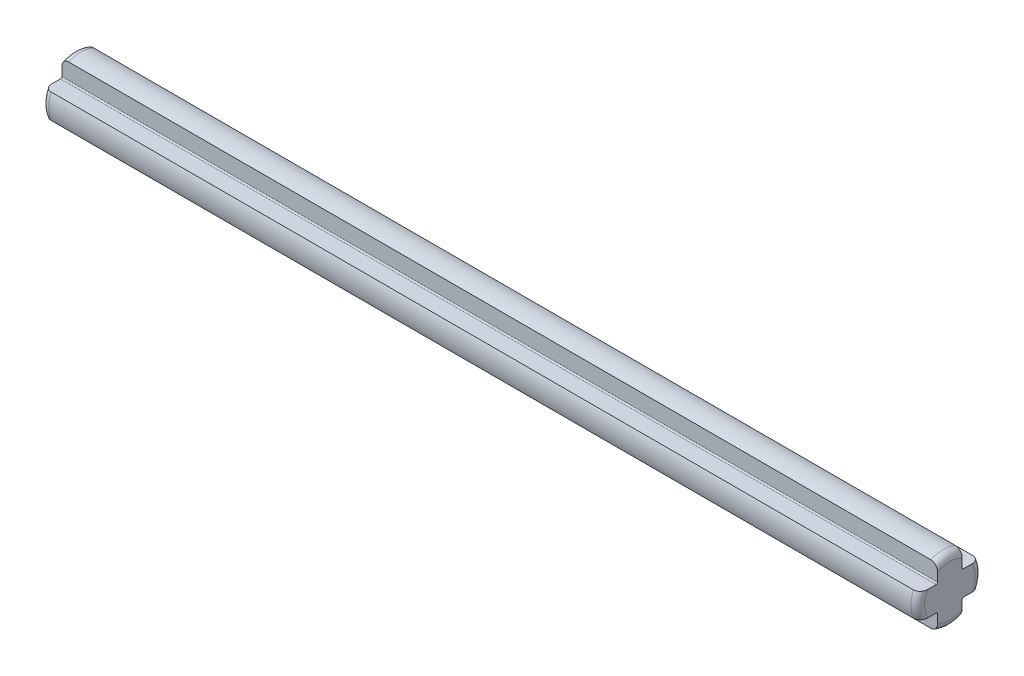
ISO-10303-21;
HEADER;
FILE_DESCRIPTION(('STEP AP214'),'2;1');
FILE_NAME('part.step','',(''),(''),'','','');
FILE_SCHEMA(('AUTOMOTIVE_DESIGN { 1 0 10303 214 1 1 1 1 }'));
ENDSEC;
DATA;
#1=APPLICATION_CONTEXT('core data for automotive mechanical design processes');
#2=APPLICATION_PROTOCOL_DEFINITION('international standard','automotive_design',2000,#1);
#3=PRODUCT_CONTEXT('',#1,'mechanical');
#4=PRODUCT('Part','Part','',(#3));
#5=PRODUCT_RELATED_PRODUCT_CATEGORY('part','',(#4));
#6=PRODUCT_DEFINITION_FORMATION('','',#4);
#7=PRODUCT_DEFINITION_CONTEXT('part definition',#1,'design');
#8=PRODUCT_DEFINITION('design','',#6,#7);
#9=PRODUCT_DEFINITION_SHAPE('','',#8);
#10=(LENGTH_UNIT() NAMED_UNIT(*) SI_UNIT(.MILLI.,.METRE.));
#11=(NAMED_UNIT(*) PLANE_ANGLE_UNIT() SI_UNIT($,.RADIAN.));
#12=(NAMED_UNIT(*) SI_UNIT($,.STERADIAN.) SOLID_ANGLE_UNIT());
#13=UNCERTAINTY_MEASURE_WITH_UNIT(LENGTH_MEASURE(1.E-05),#10,'distance_accuracy_value','');
#14=(GEOMETRIC_REPRESENTATION_CONTEXT(3) GLOBAL_UNCERTAINTY_ASSIGNED_CONTEXT((#13)) GLOBAL_UNIT_ASSIGNED_CONTEXT((#10,
#11,#12)) REPRESENTATION_CONTEXT('',''));
#15=CARTESIAN_POINT('',(0.,0.,0.));
#16=DIRECTION('',(0.,0.,1.));
#17=DIRECTION('',(1.,0.,0.));
#18=AXIS2_PLACEMENT_3D('',#15,#16,#17);
#19=CARTESIAN_POINT('',(32.,0.,0.));
#20=DIRECTION('',(-1.,0.,0.));
#21=DIRECTION('',(0.,0.,1.));
#22=AXIS2_PLACEMENT_3D('',#19,#20,#21);
#23=CYLINDRICAL_SURFACE('',#22,2.35);
#24=DIRECTION('',(-1.,0.,0.));
#25=VECTOR('',#24,1.);
#26=CARTESIAN_POINT('',(32.,0.9,2.17082933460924));
#27=LINE('',#26,#25);
#28=CARTESIAN_POINT('',(31.5,0.9,2.17082933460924));
#29=VERTEX_POINT('',#28);
#30=CARTESIAN_POINT('',(-31.5,0.9,2.17082933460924));
#31=VERTEX_POINT('',#30);
#32=EDGE_CURVE('E250',#29,#31,#27,.T.);
#33=ORIENTED_EDGE('',*,*,#32,.T.);
#34=CARTESIAN_POINT('',(-31.5,0.,0.));
#35=DIRECTION('',(1.,0.,0.));
#36=DIRECTION('',(0.,0.,-1.));
#37=AXIS2_PLACEMENT_3D('',#34,#35,#36);
#38=CIRCLE('',#37,2.35);
#39=CARTESIAN_POINT('',(-31.5,-0.900000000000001,2.17082933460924));
#40=VERTEX_POINT('',#39);
#41=EDGE_CURVE('E515',#31,#40,#38,.T.);
#42=ORIENTED_EDGE('',*,*,#41,.T.);
#43=DIRECTION('',(-1.,0.,0.));
#44=VECTOR('',#43,1.);
#45=CARTESIAN_POINT('',(32.,-0.900000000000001,2.17082933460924));
#46=LINE('',#45,#44);
#47=CARTESIAN_POINT('',(31.5,-0.900000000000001,2.17082933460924));
#48=VERTEX_POINT('',#47);
#49=EDGE_CURVE('E221',#48,#40,#46,.T.);
#50=ORIENTED_EDGE('',*,*,#49,.F.);
#51=CARTESIAN_POINT('',(31.5,0.,0.));
#52=DIRECTION('',(1.,0.,0.));
#53=DIRECTION('',(0.,0.,-1.));
#54=AXIS2_PLACEMENT_3D('',#51,#52,#53);
#55=CIRCLE('',#54,2.35);
#56=EDGE_CURVE('E370',#48,#29,#55,.F.);
#57=ORIENTED_EDGE('',*,*,#56,.T.);
#58=EDGE_LOOP('',(#33,#42,#50,#57));
#59=FACE_BOUND('',#58,.T.);
#60=ADVANCED_FACE('F37',(#59),#23,.T.);
#61=CARTESIAN_POINT('',(32.,-0.900000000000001,2.17082933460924));
#62=DIRECTION('',(0.,1.,0.));
#63=DIRECTION('',(0.,0.,1.));
#64=AXIS2_PLACEMENT_3D('',#61,#62,#63);
#65=PLANE('',#64);
#66=ORIENTED_EDGE('',*,*,#49,.T.);
#67=CARTESIAN_POINT('',(-31.5,-0.900000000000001,2.17082933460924));
#68=CARTESIAN_POINT('',(-31.5264833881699,-0.900000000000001,2.17085986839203));
#69=CARTESIAN_POINT('',(-31.5529498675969,-0.900000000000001,2.16855372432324));
#70=CARTESIAN_POINT('',(-31.6050453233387,-0.900000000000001,2.15950506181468));
#71=CARTESIAN_POINT('',(-31.6306762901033,-0.900000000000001,2.15277404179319));
#72=CARTESIAN_POINT('',(-31.6804387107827,-0.900000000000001,2.1351114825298));
#73=CARTESIAN_POINT('',(-31.7045703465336,-0.900000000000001,2.12418045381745));
#74=CARTESIAN_POINT('',(-31.7507251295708,-0.900000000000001,2.09852306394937));
#75=CARTESIAN_POINT('',(-31.7727475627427,-0.900000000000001,2.0837954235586));
#76=CARTESIAN_POINT('',(-31.8147234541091,-0.900000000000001,2.05060839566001));
#77=CARTESIAN_POINT('',(-31.8346070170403,-0.900000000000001,2.03206082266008));
#78=CARTESIAN_POINT('',(-31.8712243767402,-0.900000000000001,1.99209288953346));
#79=CARTESIAN_POINT('',(-31.8879579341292,-0.900000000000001,1.97067231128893));
#80=CARTESIAN_POINT('',(-31.9190973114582,-0.900000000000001,1.92396602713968));
#81=CARTESIAN_POINT('',(-31.9332527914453,-0.900000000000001,1.89851375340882));
#82=CARTESIAN_POINT('',(-31.9575247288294,-0.900000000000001,1.84573102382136));
#83=CARTESIAN_POINT('',(-31.9676367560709,-0.900000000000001,1.81839854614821));
#84=CARTESIAN_POINT('',(-31.9838866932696,-0.900000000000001,1.76219756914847));
#85=CARTESIAN_POINT('',(-31.9899702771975,-0.900000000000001,1.73331353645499));
#86=CARTESIAN_POINT('',(-31.9980270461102,-0.900000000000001,1.67505065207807));
#87=CARTESIAN_POINT('',(-32.0000109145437,-0.900000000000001,1.64567328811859));
#88=CARTESIAN_POINT('',(-32.,-0.900000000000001,1.61632298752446));
#89=B_SPLINE_CURVE_WITH_KNOTS('',3,(#67,#68,#69,#70,#71,#72,#73,#74,#75,#76,#77,#78,#79,#80,#81,
#82,#83,#84,#85,#86,#87,#88),.UNSPECIFIED.,.F.,.F.,(4,2,2,2,2,2,2,2,2,2,4),(0.,
0.0793238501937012,0.158442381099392,0.237551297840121,0.316686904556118,0.397909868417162,
0.479139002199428,0.56614777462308,0.653251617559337,0.74150740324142,0.829532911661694),.UNSPECIFIED.);
#90=CARTESIAN_POINT('',(-32.,-0.900000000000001,1.61632298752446));
#91=VERTEX_POINT('',#90);
#92=EDGE_CURVE('E390',#40,#91,#89,.T.);
#93=ORIENTED_EDGE('',*,*,#92,.T.);
#94=DIRECTION('',(0.,0.,-1.));
#95=VECTOR('',#94,1.);
#96=CARTESIAN_POINT('',(-32.,-0.900000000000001,2.17082933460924));
#97=LINE('',#96,#95);
#98=CARTESIAN_POINT('',(-32.,-0.900000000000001,0.999999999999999));
#99=VERTEX_POINT('',#98);
#100=EDGE_CURVE('E218',#91,#99,#97,.T.);
#101=ORIENTED_EDGE('',*,*,#100,.T.);
#102=DIRECTION('',(-1.,0.,0.));
#103=VECTOR('',#102,1.);
#104=CARTESIAN_POINT('',(32.,-0.900000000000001,0.999999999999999));
#105=LINE('',#104,#103);
#106=CARTESIAN_POINT('',(32.,-0.900000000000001,0.999999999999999));
#107=VERTEX_POINT('',#106);
#108=EDGE_CURVE('E214',#107,#99,#105,.T.);
#109=ORIENTED_EDGE('',*,*,#108,.F.);
#110=DIRECTION('',(0.,0.,-1.));
#111=VECTOR('',#110,1.);
#112=CARTESIAN_POINT('',(32.,-0.900000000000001,2.17082933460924));
#113=LINE('',#112,#111);
#114=CARTESIAN_POINT('',(32.,-0.900000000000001,1.61632298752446));
#115=VERTEX_POINT('',#114);
#116=EDGE_CURVE('E201',#115,#107,#113,.T.);
#117=ORIENTED_EDGE('',*,*,#116,.F.);
#118=CARTESIAN_POINT('',(32.,-0.900000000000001,1.61632298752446));
#119=CARTESIAN_POINT('',(32.0000222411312,-0.900000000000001,1.65066661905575));
#120=CARTESIAN_POINT('',(31.9972983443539,-0.900000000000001,1.68506058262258));
#121=CARTESIAN_POINT('',(31.9862156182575,-0.900000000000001,1.75308687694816));
#122=CARTESIAN_POINT('',(31.9778303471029,-0.900000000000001,1.78671486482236));
#123=CARTESIAN_POINT('',(31.9552419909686,-0.900000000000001,1.85211366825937));
#124=CARTESIAN_POINT('',(31.9410195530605,-0.900000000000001,1.88387790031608));
#125=CARTESIAN_POINT('',(31.9069131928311,-0.900000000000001,1.94414749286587));
#126=CARTESIAN_POINT('',(31.8870416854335,-0.900000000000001,1.97265980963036));
#127=CARTESIAN_POINT('',(31.844222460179,-0.900000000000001,2.02268935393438));
#128=CARTESIAN_POINT('',(31.8217526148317,-0.900000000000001,2.04461521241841));
#129=CARTESIAN_POINT('',(31.7730890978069,-0.900000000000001,2.08389547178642));
#130=CARTESIAN_POINT('',(31.7468952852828,-0.900000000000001,2.10124969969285));
#131=CARTESIAN_POINT('',(31.6943438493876,-0.900000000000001,2.12912089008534));
#132=CARTESIAN_POINT('',(31.6682509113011,-0.900000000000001,2.14013932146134));
#133=CARTESIAN_POINT('',(31.6145341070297,-0.900000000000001,2.15730052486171));
#134=CARTESIAN_POINT('',(31.586913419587,-0.900000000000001,2.1634530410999));
#135=CARTESIAN_POINT('',(31.5492135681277,-0.900000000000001,2.16830749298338));
#136=CARTESIAN_POINT('',(31.5393866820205,-0.900000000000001,2.1692533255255));
#137=CARTESIAN_POINT('',(31.5197081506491,-0.900000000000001,2.17051341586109));
#138=CARTESIAN_POINT('',(31.5098565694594,-0.900000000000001,2.17082867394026));
#139=CARTESIAN_POINT('',(31.5,-0.900000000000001,2.17082933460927));
#140=B_SPLINE_CURVE_WITH_KNOTS('',3,(#118,#119,#120,#121,#122,#123,#124,#125,#126,#127,#128,
#129,#130,#131,#132,#133,#134,#135,#136,#137,#138,#139),.UNSPECIFIED.,.F.,.F.,(4,2,2,2,2,2,2,2,
2,2,4),(0.,0.10300027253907,0.206484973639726,0.310315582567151,0.413919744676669,
0.507586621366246,0.601257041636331,0.68579977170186,0.770172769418,0.799774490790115,
0.829329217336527),.UNSPECIFIED.);
#141=EDGE_CURVE('E520',#115,#48,#140,.T.);
#142=ORIENTED_EDGE('',*,*,#141,.T.);
#143=EDGE_LOOP('',(#66,#93,#101,#109,#117,#142));
#144=FACE_BOUND('',#143,.T.);
#145=ADVANCED_FACE('F216',(#144),#65,.F.);
#146=CARTESIAN_POINT('',(32.,-1.,0.999999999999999));
#147=DIRECTION('',(-1.,0.,0.));
#148=DIRECTION('',(0.,0.,1.));
#149=AXIS2_PLACEMENT_3D('',#146,#147,#148);
#150=CYLINDRICAL_SURFACE('',#149,0.0999999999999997);
#151=CARTESIAN_POINT('',(-32.,-1.,0.999999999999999));
#152=DIRECTION('',(-1.,0.,0.));
#153=DIRECTION('',(0.,0.,1.));
#154=AXIS2_PLACEMENT_3D('',#151,#152,#153);
#155=CIRCLE('',#154,0.0999999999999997);
#156=CARTESIAN_POINT('',(-32.,-1.,0.899999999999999));
#157=VERTEX_POINT('',#156);
#158=EDGE_CURVE('E252',#99,#157,#155,.T.);
#159=ORIENTED_EDGE('',*,*,#158,.T.);
#160=DIRECTION('',(-1.,0.,0.));
#161=VECTOR('',#160,1.);
#162=CARTESIAN_POINT('',(32.,-1.,0.899999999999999));
#163=LINE('',#162,#161);
#164=CARTESIAN_POINT('',(32.,-1.,0.899999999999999));
#165=VERTEX_POINT('',#164);
#166=EDGE_CURVE('E222',#165,#157,#163,.T.);
#167=ORIENTED_EDGE('',*,*,#166,.F.);
#168=CARTESIAN_POINT('',(32.,-1.,0.999999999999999));
#169=DIRECTION('',(-1.,0.,0.));
#170=DIRECTION('',(0.,0.,1.));
#171=AXIS2_PLACEMENT_3D('',#168,#169,#170);
#172=CIRCLE('',#171,0.0999999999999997);
#173=EDGE_CURVE('E207',#107,#165,#172,.T.);
#174=ORIENTED_EDGE('',*,*,#173,.F.);
#175=ORIENTED_EDGE('',*,*,#108,.T.);
#176=EDGE_LOOP('',(#159,#167,#174,#175));
#177=FACE_BOUND('',#176,.T.);
#178=ADVANCED_FACE('F224',(#177),#150,.F.);
#179=CARTESIAN_POINT('',(32.,-2.17082933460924,0.899999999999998));
#180=DIRECTION('',(0.,0.,-1.));
#181=DIRECTION('',(0.,1.,0.));
#182=AXIS2_PLACEMENT_3D('',#179,#180,#181);
#183=PLANE('',#182);
#184=DIRECTION('',(0.,-1.,0.));
#185=VECTOR('',#184,1.);
#186=CARTESIAN_POINT('',(-32.,-2.17082933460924,0.899999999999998));
#187=LINE('',#186,#185);
#188=CARTESIAN_POINT('',(-32.,-1.61632298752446,0.899999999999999));
#189=VERTEX_POINT('',#188);
#190=EDGE_CURVE('E254',#157,#189,#187,.T.);
#191=ORIENTED_EDGE('',*,*,#190,.T.);
#192=CARTESIAN_POINT('',(-32.,-1.61632298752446,0.899999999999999));
#193=CARTESIAN_POINT('',(-32.0000222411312,-1.65066661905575,0.899999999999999));
#194=CARTESIAN_POINT('',(-31.9972983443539,-1.68506058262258,0.899999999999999));
#195=CARTESIAN_POINT('',(-31.9862156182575,-1.75308687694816,0.899999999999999));
#196=CARTESIAN_POINT('',(-31.9778303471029,-1.78671486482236,0.899999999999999));
#197=CARTESIAN_POINT('',(-31.9552419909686,-1.85211366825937,0.899999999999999));
#198=CARTESIAN_POINT('',(-31.9410195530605,-1.88387790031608,0.899999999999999));
#199=CARTESIAN_POINT('',(-31.9069131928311,-1.94414749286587,0.899999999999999));
#200=CARTESIAN_POINT('',(-31.8870416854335,-1.97265980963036,0.899999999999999));
#201=CARTESIAN_POINT('',(-31.844222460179,-2.02268935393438,0.899999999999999));
#202=CARTESIAN_POINT('',(-31.8217526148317,-2.04461521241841,0.899999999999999));
#203=CARTESIAN_POINT('',(-31.7730890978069,-2.08389547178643,0.899999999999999));
#204=CARTESIAN_POINT('',(-31.7468952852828,-2.10124969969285,0.899999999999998));
#205=CARTESIAN_POINT('',(-31.6943438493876,-2.12912089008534,0.899999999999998));
#206=CARTESIAN_POINT('',(-31.6682509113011,-2.14013932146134,0.899999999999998));
#207=CARTESIAN_POINT('',(-31.6145341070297,-2.15730052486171,0.899999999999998));
#208=CARTESIAN_POINT('',(-31.586913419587,-2.1634530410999,0.899999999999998));
#209=CARTESIAN_POINT('',(-31.5492135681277,-2.16830749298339,0.899999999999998));
#210=CARTESIAN_POINT('',(-31.5393866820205,-2.1692533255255,0.899999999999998));
#211=CARTESIAN_POINT('',(-31.5197081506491,-2.17051341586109,0.899999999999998));
#212=CARTESIAN_POINT('',(-31.5098565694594,-2.17082867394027,0.899999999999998));
#213=CARTESIAN_POINT('',(-31.5,-2.17082933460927,0.899999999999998));
#214=B_SPLINE_CURVE_WITH_KNOTS('',3,(#192,#193,#194,#195,#196,#197,#198,#199,#200,#201,#202,
#203,#204,#205,#206,#207,#208,#209,#210,#211,#212,#213),.UNSPECIFIED.,.F.,.F.,(4,2,2,2,2,2,2,2,
2,2,4),(0.,0.103000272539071,0.206484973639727,0.310315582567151,0.413919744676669,
0.507586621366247,0.601257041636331,0.68579977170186,0.770172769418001,0.799774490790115,
0.829329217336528),.UNSPECIFIED.);
#215=CARTESIAN_POINT('',(-31.5,-2.17082933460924,0.899999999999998));
#216=VERTEX_POINT('',#215);
#217=EDGE_CURVE('E365',#189,#216,#214,.T.);
#218=ORIENTED_EDGE('',*,*,#217,.T.);
#219=DIRECTION('',(-1.,0.,0.));
#220=VECTOR('',#219,1.);
#221=CARTESIAN_POINT('',(32.,-2.17082933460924,0.899999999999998));
#222=LINE('',#221,#220);
#223=CARTESIAN_POINT('',(31.5,-2.17082933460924,0.899999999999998));
#224=VERTEX_POINT('',#223);
#225=EDGE_CURVE('E312',#224,#216,#222,.T.);
#226=ORIENTED_EDGE('',*,*,#225,.F.);
#227=CARTESIAN_POINT('',(31.5,-2.17082933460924,0.899999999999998));
#228=CARTESIAN_POINT('',(31.5264833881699,-2.17085986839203,0.899999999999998));
#229=CARTESIAN_POINT('',(31.5529498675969,-2.16855372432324,0.899999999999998));
#230=CARTESIAN_POINT('',(31.6050453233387,-2.15950506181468,0.899999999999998));
#231=CARTESIAN_POINT('',(31.6306762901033,-2.15277404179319,0.899999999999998));
#232=CARTESIAN_POINT('',(31.6804387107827,-2.1351114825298,0.899999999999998));
#233=CARTESIAN_POINT('',(31.7045703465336,-2.12418045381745,0.899999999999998));
#234=CARTESIAN_POINT('',(31.7507251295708,-2.09852306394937,0.899999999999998));
#235=CARTESIAN_POINT('',(31.7727475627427,-2.0837954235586,0.899999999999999));
#236=CARTESIAN_POINT('',(31.8147234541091,-2.05060839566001,0.899999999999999));
#237=CARTESIAN_POINT('',(31.8346070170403,-2.03206082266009,0.899999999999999));
#238=CARTESIAN_POINT('',(31.8712243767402,-1.99209288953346,0.899999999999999));
#239=CARTESIAN_POINT('',(31.8879579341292,-1.97067231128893,0.899999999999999));
#240=CARTESIAN_POINT('',(31.9190973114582,-1.92396602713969,0.899999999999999));
#241=CARTESIAN_POINT('',(31.9332527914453,-1.89851375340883,0.899999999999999));
#242=CARTESIAN_POINT('',(31.9575247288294,-1.84573102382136,0.899999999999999));
#243=CARTESIAN_POINT('',(31.9676367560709,-1.81839854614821,0.899999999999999));
#244=CARTESIAN_POINT('',(31.9838866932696,-1.76219756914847,0.899999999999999));
#245=CARTESIAN_POINT('',(31.9899702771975,-1.733313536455,0.899999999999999));
#246=CARTESIAN_POINT('',(31.9980270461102,-1.67505065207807,0.899999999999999));
#247=CARTESIAN_POINT('',(32.0000109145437,-1.64567328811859,0.899999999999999));
#248=CARTESIAN_POINT('',(32.,-1.61632298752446,0.899999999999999));
#249=B_SPLINE_CURVE_WITH_KNOTS('',3,(#227,#228,#229,#230,#231,#232,#233,#234,#235,#236,#237,
#238,#239,#240,#241,#242,#243,#244,#245,#246,#247,#248),.UNSPECIFIED.,.F.,.F.,(4,2,2,2,2,2,2,2,
2,2,4),(0.,0.0793238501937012,0.158442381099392,0.237551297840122,0.316686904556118,
0.397909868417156,0.479139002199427,0.566147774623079,0.653251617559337,0.741507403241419,
0.829532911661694),.UNSPECIFIED.);
#250=CARTESIAN_POINT('',(32.,-1.61632298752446,0.899999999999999));
#251=VERTEX_POINT('',#250);
#252=EDGE_CURVE('E359',#224,#251,#249,.T.);
#253=ORIENTED_EDGE('',*,*,#252,.T.);
#254=DIRECTION('',(0.,-1.,0.));
#255=VECTOR('',#254,1.);
#256=CARTESIAN_POINT('',(32.,-2.17082933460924,0.899999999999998));
#257=LINE('',#256,#255);
#258=EDGE_CURVE('E227',#165,#251,#257,.T.);
#259=ORIENTED_EDGE('',*,*,#258,.F.);
#260=ORIENTED_EDGE('',*,*,#166,.T.);
#261=EDGE_LOOP('',(#191,#218,#226,#253,#259,#260));
#262=FACE_BOUND('',#261,.T.);
#263=ADVANCED_FACE('F350',(#262),#183,.F.);
#264=CARTESIAN_POINT('',(32.,0.,0.));
#265=DIRECTION('',(-1.,0.,0.));
#266=DIRECTION('',(0.,0.,1.));
#267=AXIS2_PLACEMENT_3D('',#264,#265,#266);
#268=CYLINDRICAL_SURFACE('',#267,2.35);
#269=ORIENTED_EDGE('',*,*,#225,.T.);
#270=CARTESIAN_POINT('',(-31.5,0.,0.));
#271=DIRECTION('',(1.,0.,0.));
#272=DIRECTION('',(0.,0.,-1.));
#273=AXIS2_PLACEMENT_3D('',#270,#271,#272);
#274=CIRCLE('',#273,2.35);
#275=CARTESIAN_POINT('',(-31.5,-2.17082933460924,-0.9));
#276=VERTEX_POINT('',#275);
#277=EDGE_CURVE('E319',#216,#276,#274,.T.);
#278=ORIENTED_EDGE('',*,*,#277,.T.);
#279=DIRECTION('',(-1.,0.,0.));
#280=VECTOR('',#279,1.);
#281=CARTESIAN_POINT('',(32.,-2.17082933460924,-0.9));
#282=LINE('',#281,#280);
#283=CARTESIAN_POINT('',(31.5,-2.17082933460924,-0.9));
#284=VERTEX_POINT('',#283);
#285=EDGE_CURVE('E309',#284,#276,#282,.T.);
#286=ORIENTED_EDGE('',*,*,#285,.F.);
#287=CARTESIAN_POINT('',(31.5,0.,0.));
#288=DIRECTION('',(1.,0.,0.));
#289=DIRECTION('',(0.,0.,-1.));
#290=AXIS2_PLACEMENT_3D('',#287,#288,#289);
#291=CIRCLE('',#290,2.35);
#292=EDGE_CURVE('E317',#284,#224,#291,.F.);
#293=ORIENTED_EDGE('',*,*,#292,.T.);
#294=EDGE_LOOP('',(#269,#278,#286,#293));
#295=FACE_BOUND('',#294,.T.);
#296=ADVANCED_FACE('F344',(#295),#268,.T.);
#297=CARTESIAN_POINT('',(32.,-2.17082933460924,-0.9));
#298=DIRECTION('',(0.,0.,1.));
#299=DIRECTION('',(0.,-1.,0.));
#300=AXIS2_PLACEMENT_3D('',#297,#298,#299);
#301=PLANE('',#300);
#302=ORIENTED_EDGE('',*,*,#285,.T.);
#303=CARTESIAN_POINT('',(-31.5,-2.17082933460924,-0.9));
#304=CARTESIAN_POINT('',(-31.5264833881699,-2.17085986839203,-0.9));
#305=CARTESIAN_POINT('',(-31.5529498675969,-2.16855372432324,-0.9));
#306=CARTESIAN_POINT('',(-31.6050453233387,-2.15950506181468,-0.9));
#307=CARTESIAN_POINT('',(-31.6306762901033,-2.15277404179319,-0.9));
#308=CARTESIAN_POINT('',(-31.6804387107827,-2.1351114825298,-0.9));
#309=CARTESIAN_POINT('',(-31.7045703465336,-2.12418045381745,-0.9));
#310=CARTESIAN_POINT('',(-31.7507251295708,-2.09852306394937,-0.9));
#311=CARTESIAN_POINT('',(-31.7727475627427,-2.0837954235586,-0.9));
#312=CARTESIAN_POINT('',(-31.8147234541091,-2.05060839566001,-0.9));
#313=CARTESIAN_POINT('',(-31.8346070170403,-2.03206082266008,-0.9));
#314=CARTESIAN_POINT('',(-31.8712243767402,-1.99209288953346,-0.9));
#315=CARTESIAN_POINT('',(-31.8879579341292,-1.97067231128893,-0.9));
#316=CARTESIAN_POINT('',(-31.9190973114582,-1.92396602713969,-0.9));
#317=CARTESIAN_POINT('',(-31.9332527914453,-1.89851375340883,-0.9));
#318=CARTESIAN_POINT('',(-31.9575247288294,-1.84573102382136,-0.9));
#319=CARTESIAN_POINT('',(-31.9676367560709,-1.81839854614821,-0.9));
#320=CARTESIAN_POINT('',(-31.9838866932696,-1.76219756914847,-0.9));
#321=CARTESIAN_POINT('',(-31.9899702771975,-1.73331353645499,-0.9));
#322=CARTESIAN_POINT('',(-31.9980270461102,-1.67505065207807,-0.9));
#323=CARTESIAN_POINT('',(-32.0000109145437,-1.64567328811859,-0.9));
#324=CARTESIAN_POINT('',(-32.,-1.61632298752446,-0.9));
#325=B_SPLINE_CURVE_WITH_KNOTS('',3,(#303,#304,#305,#306,#307,#308,#309,#310,#311,#312,#313,
#314,#315,#316,#317,#318,#319,#320,#321,#322,#323,#324),.UNSPECIFIED.,.F.,.F.,(4,2,2,2,2,2,2,2,
2,2,4),(0.,0.0793238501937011,0.158442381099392,0.237551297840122,0.316686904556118,
0.397909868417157,0.479139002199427,0.566147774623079,0.653251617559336,0.74150740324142,
0.829532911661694),.UNSPECIFIED.);
#326=CARTESIAN_POINT('',(-32.,-1.61632298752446,-0.9));
#327=VERTEX_POINT('',#326);
#328=EDGE_CURVE('E329',#276,#327,#325,.T.);
#329=ORIENTED_EDGE('',*,*,#328,.T.);
#330=DIRECTION('',(0.,1.,0.));
#331=VECTOR('',#330,1.);
#332=CARTESIAN_POINT('',(-32.,-2.17082933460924,-0.9));
#333=LINE('',#332,#331);
#334=CARTESIAN_POINT('',(-32.,-1.,-0.9));
#335=VERTEX_POINT('',#334);
#336=EDGE_CURVE('E257',#327,#335,#333,.T.);
#337=ORIENTED_EDGE('',*,*,#336,.T.);
#338=DIRECTION('',(-1.,0.,0.));
#339=VECTOR('',#338,1.);
#340=CARTESIAN_POINT('',(32.,-1.,-0.9));
#341=LINE('',#340,#339);
#342=CARTESIAN_POINT('',(32.,-1.,-0.9));
#343=VERTEX_POINT('',#342);
#344=EDGE_CURVE('E306',#343,#335,#341,.T.);
#345=ORIENTED_EDGE('',*,*,#344,.F.);
#346=DIRECTION('',(0.,1.,0.));
#347=VECTOR('',#346,1.);
#348=CARTESIAN_POINT('',(32.,-2.17082933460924,-0.9));
#349=LINE('',#348,#347);
#350=CARTESIAN_POINT('',(32.,-1.61632298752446,-0.9));
#351=VERTEX_POINT('',#350);
#352=EDGE_CURVE('E229',#351,#343,#349,.T.);
#353=ORIENTED_EDGE('',*,*,#352,.F.);
#354=CARTESIAN_POINT('',(32.,-1.61632298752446,-0.9));
#355=CARTESIAN_POINT('',(32.0000222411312,-1.65066661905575,-0.9));
#356=CARTESIAN_POINT('',(31.9972983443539,-1.68506058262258,-0.9));
#357=CARTESIAN_POINT('',(31.9862156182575,-1.75308687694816,-0.9));
#358=CARTESIAN_POINT('',(31.9778303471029,-1.78671486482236,-0.9));
#359=CARTESIAN_POINT('',(31.9552419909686,-1.85211366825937,-0.9));
#360=CARTESIAN_POINT('',(31.9410195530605,-1.88387790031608,-0.9));
#361=CARTESIAN_POINT('',(31.9069131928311,-1.94414749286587,-0.9));
#362=CARTESIAN_POINT('',(31.8870416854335,-1.97265980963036,-0.9));
#363=CARTESIAN_POINT('',(31.844222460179,-2.02268935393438,-0.9));
#364=CARTESIAN_POINT('',(31.8217526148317,-2.04461521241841,-0.9));
#365=CARTESIAN_POINT('',(31.7730890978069,-2.08389547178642,-0.9));
#366=CARTESIAN_POINT('',(31.7468952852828,-2.10124969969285,-0.9));
#367=CARTESIAN_POINT('',(31.6943438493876,-2.12912089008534,-0.9));
#368=CARTESIAN_POINT('',(31.6682509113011,-2.14013932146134,-0.9));
#369=CARTESIAN_POINT('',(31.6145341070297,-2.15730052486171,-0.9));
#370=CARTESIAN_POINT('',(31.586913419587,-2.1634530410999,-0.9));
#371=CARTESIAN_POINT('',(31.5492135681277,-2.16830749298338,-0.9));
#372=CARTESIAN_POINT('',(31.5393866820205,-2.1692533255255,-0.9));
#373=CARTESIAN_POINT('',(31.5197081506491,-2.17051341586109,-0.9));
#374=CARTESIAN_POINT('',(31.5098565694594,-2.17082867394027,-0.9));
#375=CARTESIAN_POINT('',(31.5,-2.17082933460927,-0.9));
#376=B_SPLINE_CURVE_WITH_KNOTS('',3,(#354,#355,#356,#357,#358,#359,#360,#361,#362,#363,#364,
#365,#366,#367,#368,#369,#370,#371,#372,#373,#374,#375),.UNSPECIFIED.,.F.,.F.,(4,2,2,2,2,2,2,2,
2,2,4),(0.,0.10300027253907,0.206484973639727,0.310315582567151,0.413919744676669,
0.507586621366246,0.601257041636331,0.68579977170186,0.770172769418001,0.799774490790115,
0.829329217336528),.UNSPECIFIED.);
#377=EDGE_CURVE('E322',#351,#284,#376,.T.);
#378=ORIENTED_EDGE('',*,*,#377,.T.);
#379=EDGE_LOOP('',(#302,#329,#337,#345,#353,#378));
#380=FACE_BOUND('',#379,.T.);
#381=ADVANCED_FACE('F338',(#380),#301,.F.);
#382=CARTESIAN_POINT('',(32.,-1.,-1.));
#383=DIRECTION('',(-1.,0.,0.));
#384=DIRECTION('',(0.,0.,1.));
#385=AXIS2_PLACEMENT_3D('',#382,#383,#384);
#386=CYLINDRICAL_SURFACE('',#385,0.0999999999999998);
#387=CARTESIAN_POINT('',(-32.,-1.,-1.));
#388=DIRECTION('',(-1.,0.,0.));
#389=DIRECTION('',(0.,0.,-1.));
#390=AXIS2_PLACEMENT_3D('',#387,#388,#389);
#391=CIRCLE('',#390,0.0999999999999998);
#392=CARTESIAN_POINT('',(-32.,-0.9,-1.));
#393=VERTEX_POINT('',#392);
#394=EDGE_CURVE('E259',#335,#393,#391,.T.);
#395=ORIENTED_EDGE('',*,*,#394,.T.);
#396=DIRECTION('',(-1.,0.,0.));
#397=VECTOR('',#396,1.);
#398=CARTESIAN_POINT('',(32.,-0.9,-1.));
#399=LINE('',#398,#397);
#400=CARTESIAN_POINT('',(32.,-0.9,-1.));
#401=VERTEX_POINT('',#400);
#402=EDGE_CURVE('E303',#401,#393,#399,.T.);
#403=ORIENTED_EDGE('',*,*,#402,.F.);
#404=CARTESIAN_POINT('',(32.,-1.,-1.));
#405=DIRECTION('',(-1.,0.,0.));
#406=DIRECTION('',(0.,0.,-1.));
#407=AXIS2_PLACEMENT_3D('',#404,#405,#406);
#408=CIRCLE('',#407,0.0999999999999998);
#409=EDGE_CURVE('E233',#343,#401,#408,.T.);
#410=ORIENTED_EDGE('',*,*,#409,.F.);
#411=ORIENTED_EDGE('',*,*,#344,.T.);
#412=EDGE_LOOP('',(#395,#403,#410,#411));
#413=FACE_BOUND('',#412,.T.);
#414=ADVANCED_FACE('F343',(#413),#386,.F.);
#415=CARTESIAN_POINT('',(32.,-0.900000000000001,-2.17082933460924));
#416=DIRECTION('',(0.,1.,0.));
#417=DIRECTION('',(0.,0.,1.));
#418=AXIS2_PLACEMENT_3D('',#415,#416,#417);
#419=PLANE('',#418);
#420=DIRECTION('',(0.,0.,-1.));
#421=VECTOR('',#420,1.);
#422=CARTESIAN_POINT('',(-32.,-0.900000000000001,-2.17082933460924));
#423=LINE('',#422,#421);
#424=CARTESIAN_POINT('',(-32.,-0.9,-1.61632298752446));
#425=VERTEX_POINT('',#424);
#426=EDGE_CURVE('E261',#393,#425,#423,.T.);
#427=ORIENTED_EDGE('',*,*,#426,.T.);
#428=CARTESIAN_POINT('',(-32.,-0.9,-1.61632298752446));
#429=CARTESIAN_POINT('',(-32.0000222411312,-0.9,-1.65066661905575));
#430=CARTESIAN_POINT('',(-31.9972983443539,-0.9,-1.68506058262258));
#431=CARTESIAN_POINT('',(-31.9862156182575,-0.9,-1.75308687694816));
#432=CARTESIAN_POINT('',(-31.9778303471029,-0.9,-1.78671486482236));
#433=CARTESIAN_POINT('',(-31.9552419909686,-0.9,-1.85211366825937));
#434=CARTESIAN_POINT('',(-31.9410195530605,-0.9,-1.88387790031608));
#435=CARTESIAN_POINT('',(-31.9069131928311,-0.9,-1.94414749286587));
#436=CARTESIAN_POINT('',(-31.8870416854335,-0.9,-1.97265980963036));
#437=CARTESIAN_POINT('',(-31.844222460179,-0.9,-2.02268935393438));
#438=CARTESIAN_POINT('',(-31.8217526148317,-0.900000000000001,-2.04461521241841));
#439=CARTESIAN_POINT('',(-31.7730890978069,-0.900000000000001,-2.08389547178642));
#440=CARTESIAN_POINT('',(-31.7468952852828,-0.900000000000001,-2.10124969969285));
#441=CARTESIAN_POINT('',(-31.6943438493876,-0.900000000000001,-2.12912089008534));
#442=CARTESIAN_POINT('',(-31.6682509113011,-0.900000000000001,-2.14013932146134));
#443=CARTESIAN_POINT('',(-31.6145341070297,-0.900000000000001,-2.15730052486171));
#444=CARTESIAN_POINT('',(-31.586913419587,-0.900000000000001,-2.1634530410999));
#445=CARTESIAN_POINT('',(-31.5492135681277,-0.900000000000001,-2.16830749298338));
#446=CARTESIAN_POINT('',(-31.5393866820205,-0.900000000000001,-2.1692533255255));
#447=CARTESIAN_POINT('',(-31.5197081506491,-0.900000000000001,-2.17051341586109));
#448=CARTESIAN_POINT('',(-31.5098565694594,-0.900000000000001,-2.17082867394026));
#449=CARTESIAN_POINT('',(-31.5,-0.900000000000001,-2.17082933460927));
#450=B_SPLINE_CURVE_WITH_KNOTS('',3,(#428,#429,#430,#431,#432,#433,#434,#435,#436,#437,#438,
#439,#440,#441,#442,#443,#444,#445,#446,#447,#448,#449),.UNSPECIFIED.,.F.,.F.,(4,2,2,2,2,2,2,2,
2,2,4),(0.,0.103000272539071,0.206484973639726,0.310315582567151,0.413919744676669,
0.507586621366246,0.601257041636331,0.68579977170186,0.770172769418,0.799774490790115,
0.829329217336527),.UNSPECIFIED.);
#451=CARTESIAN_POINT('',(-31.5,-0.9,-2.17082933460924));
#452=VERTEX_POINT('',#451);
#453=EDGE_CURVE('E489',#425,#452,#450,.T.);
#454=ORIENTED_EDGE('',*,*,#453,.T.);
#455=DIRECTION('',(-1.,0.,0.));
#456=VECTOR('',#455,1.);
#457=CARTESIAN_POINT('',(32.,-0.9,-2.17082933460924));
#458=LINE('',#457,#456);
#459=CARTESIAN_POINT('',(31.5,-0.9,-2.17082933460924));
#460=VERTEX_POINT('',#459);
#461=EDGE_CURVE('E300',#460,#452,#458,.T.);
#462=ORIENTED_EDGE('',*,*,#461,.F.);
#463=CARTESIAN_POINT('',(31.5,-0.9,-2.17082933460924));
#464=CARTESIAN_POINT('',(31.5264833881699,-0.9,-2.17085986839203));
#465=CARTESIAN_POINT('',(31.5529498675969,-0.900000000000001,-2.16855372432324));
#466=CARTESIAN_POINT('',(31.6050453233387,-0.900000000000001,-2.15950506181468));
#467=CARTESIAN_POINT('',(31.6306762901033,-0.900000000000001,-2.15277404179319));
#468=CARTESIAN_POINT('',(31.6804387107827,-0.900000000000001,-2.1351114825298));
#469=CARTESIAN_POINT('',(31.7045703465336,-0.900000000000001,-2.12418045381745));
#470=CARTESIAN_POINT('',(31.7507251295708,-0.900000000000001,-2.09852306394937));
#471=CARTESIAN_POINT('',(31.7727475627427,-0.900000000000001,-2.0837954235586));
#472=CARTESIAN_POINT('',(31.8147234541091,-0.900000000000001,-2.05060839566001));
#473=CARTESIAN_POINT('',(31.8346070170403,-0.9,-2.03206082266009));
#474=CARTESIAN_POINT('',(31.8712243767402,-0.9,-1.99209288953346));
#475=CARTESIAN_POINT('',(31.8879579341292,-0.9,-1.97067231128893));
#476=CARTESIAN_POINT('',(31.9190973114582,-0.9,-1.92396602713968));
#477=CARTESIAN_POINT('',(31.9332527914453,-0.9,-1.89851375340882));
#478=CARTESIAN_POINT('',(31.9575247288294,-0.9,-1.84573102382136));
#479=CARTESIAN_POINT('',(31.9676367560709,-0.9,-1.81839854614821));
#480=CARTESIAN_POINT('',(31.9838866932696,-0.9,-1.76219756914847));
#481=CARTESIAN_POINT('',(31.9899702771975,-0.9,-1.73331353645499));
#482=CARTESIAN_POINT('',(31.9980270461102,-0.9,-1.67505065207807));
#483=CARTESIAN_POINT('',(32.0000109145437,-0.9,-1.64567328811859));
#484=CARTESIAN_POINT('',(32.,-0.9,-1.61632298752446));
#485=B_SPLINE_CURVE_WITH_KNOTS('',3,(#463,#464,#465,#466,#467,#468,#469,#470,#471,#472,#473,
#474,#475,#476,#477,#478,#479,#480,#481,#482,#483,#484),.UNSPECIFIED.,.F.,.F.,(4,2,2,2,2,2,2,2,
2,2,4),(0.,0.0793238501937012,0.158442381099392,0.237551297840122,0.316686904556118,
0.397909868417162,0.479139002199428,0.56614777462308,0.653251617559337,0.74150740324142,
0.829532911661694),.UNSPECIFIED.);
#486=CARTESIAN_POINT('',(32.,-0.9,-1.61632298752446));
#487=VERTEX_POINT('',#486);
#488=EDGE_CURVE('E53',#460,#487,#485,.T.);
#489=ORIENTED_EDGE('',*,*,#488,.T.);
#490=DIRECTION('',(0.,0.,-1.));
#491=VECTOR('',#490,1.);
#492=CARTESIAN_POINT('',(32.,-0.900000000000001,-2.17082933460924));
#493=LINE('',#492,#491);
#494=EDGE_CURVE('E235',#401,#487,#493,.T.);
#495=ORIENTED_EDGE('',*,*,#494,.F.);
#496=ORIENTED_EDGE('',*,*,#402,.T.);
#497=EDGE_LOOP('',(#427,#454,#462,#489,#495,#496));
#498=FACE_BOUND('',#497,.T.);
#499=ADVANCED_FACE('F496',(#498),#419,.F.);
#500=CARTESIAN_POINT('',(32.,0.,0.));
#501=DIRECTION('',(-1.,0.,0.));
#502=DIRECTION('',(0.,0.,1.));
#503=AXIS2_PLACEMENT_3D('',#500,#501,#502);
#504=CYLINDRICAL_SURFACE('',#503,2.35);
#505=ORIENTED_EDGE('',*,*,#461,.T.);
#506=CARTESIAN_POINT('',(-31.5,0.,0.));
#507=DIRECTION('',(1.,0.,0.));
#508=DIRECTION('',(0.,0.,-1.));
#509=AXIS2_PLACEMENT_3D('',#506,#507,#508);
#510=CIRCLE('',#509,2.35);
#511=CARTESIAN_POINT('',(-31.5,0.900000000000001,-2.17082933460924));
#512=VERTEX_POINT('',#511);
#513=EDGE_CURVE('E575',#452,#512,#510,.T.);
#514=ORIENTED_EDGE('',*,*,#513,.T.);
#515=DIRECTION('',(-1.,0.,0.));
#516=VECTOR('',#515,1.);
#517=CARTESIAN_POINT('',(32.,0.900000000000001,-2.17082933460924));
#518=LINE('',#517,#516);
#519=CARTESIAN_POINT('',(31.5,0.900000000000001,-2.17082933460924));
#520=VERTEX_POINT('',#519);
#521=EDGE_CURVE('E297',#520,#512,#518,.T.);
#522=ORIENTED_EDGE('',*,*,#521,.F.);
#523=CARTESIAN_POINT('',(31.5,0.,0.));
#524=DIRECTION('',(1.,0.,0.));
#525=DIRECTION('',(0.,0.,-1.));
#526=AXIS2_PLACEMENT_3D('',#523,#524,#525);
#527=CIRCLE('',#526,2.35);
#528=EDGE_CURVE('E574',#520,#460,#527,.F.);
#529=ORIENTED_EDGE('',*,*,#528,.T.);
#530=EDGE_LOOP('',(#505,#514,#522,#529));
#531=FACE_BOUND('',#530,.T.);
#532=ADVANCED_FACE('F464',(#531),#504,.T.);
#533=CARTESIAN_POINT('',(32.,0.900000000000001,-2.17082933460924));
#534=DIRECTION('',(0.,-1.,0.));
#535=DIRECTION('',(0.,0.,-1.));
#536=AXIS2_PLACEMENT_3D('',#533,#534,#535);
#537=PLANE('',#536);
#538=ORIENTED_EDGE('',*,*,#521,.T.);
#539=CARTESIAN_POINT('',(-31.5,0.900000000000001,-2.17082933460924));
#540=CARTESIAN_POINT('',(-31.5264833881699,0.900000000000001,-2.17085986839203));
#541=CARTESIAN_POINT('',(-31.5529498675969,0.900000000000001,-2.16855372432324));
#542=CARTESIAN_POINT('',(-31.6050453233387,0.900000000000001,-2.15950506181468));
#543=CARTESIAN_POINT('',(-31.6306762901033,0.900000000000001,-2.15277404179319));
#544=CARTESIAN_POINT('',(-31.6804387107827,0.900000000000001,-2.1351114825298));
#545=CARTESIAN_POINT('',(-31.7045703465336,0.900000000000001,-2.12418045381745));
#546=CARTESIAN_POINT('',(-31.7507251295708,0.900000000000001,-2.09852306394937));
#547=CARTESIAN_POINT('',(-31.7727475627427,0.900000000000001,-2.0837954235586));
#548=CARTESIAN_POINT('',(-31.8147234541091,0.900000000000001,-2.05060839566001));
#549=CARTESIAN_POINT('',(-31.8346070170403,0.9,-2.03206082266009));
#550=CARTESIAN_POINT('',(-31.8712243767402,0.9,-1.99209288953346));
#551=CARTESIAN_POINT('',(-31.8879579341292,0.9,-1.97067231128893));
#552=CARTESIAN_POINT('',(-31.9190973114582,0.9,-1.92396602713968));
#553=CARTESIAN_POINT('',(-31.9332527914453,0.9,-1.89851375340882));
#554=CARTESIAN_POINT('',(-31.9575247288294,0.9,-1.84573102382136));
#555=CARTESIAN_POINT('',(-31.9676367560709,0.9,-1.81839854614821));
#556=CARTESIAN_POINT('',(-31.9838866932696,0.9,-1.76219756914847));
#557=CARTESIAN_POINT('',(-31.9899702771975,0.9,-1.73331353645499));
#558=CARTESIAN_POINT('',(-31.9980270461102,0.9,-1.67505065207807));
#559=CARTESIAN_POINT('',(-32.0000109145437,0.9,-1.64567328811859));
#560=CARTESIAN_POINT('',(-32.,0.9,-1.61632298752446));
#561=B_SPLINE_CURVE_WITH_KNOTS('',3,(#539,#540,#541,#542,#543,#544,#545,#546,#547,#548,#549,
#550,#551,#552,#553,#554,#555,#556,#557,#558,#559,#560),.UNSPECIFIED.,.F.,.F.,(4,2,2,2,2,2,2,2,
2,2,4),(0.,0.0793238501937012,0.158442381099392,0.237551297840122,0.316686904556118,
0.397909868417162,0.479139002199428,0.56614777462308,0.653251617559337,0.74150740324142,
0.829532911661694),.UNSPECIFIED.);
#562=CARTESIAN_POINT('',(-32.,0.9,-1.61632298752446));
#563=VERTEX_POINT('',#562);
#564=EDGE_CURVE('E473',#512,#563,#561,.T.);
#565=ORIENTED_EDGE('',*,*,#564,.T.);
#566=DIRECTION('',(0.,0.,1.));
#567=VECTOR('',#566,1.);
#568=CARTESIAN_POINT('',(-32.,0.900000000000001,-2.17082933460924));
#569=LINE('',#568,#567);
#570=CARTESIAN_POINT('',(-32.,0.9,-1.));
#571=VERTEX_POINT('',#570);
#572=EDGE_CURVE('E264',#563,#571,#569,.T.);
#573=ORIENTED_EDGE('',*,*,#572,.T.);
#574=DIRECTION('',(-1.,0.,0.));
#575=VECTOR('',#574,1.);
#576=CARTESIAN_POINT('',(32.,0.9,-1.));
#577=LINE('',#576,#575);
#578=CARTESIAN_POINT('',(32.,0.9,-1.));
#579=VERTEX_POINT('',#578);
#580=EDGE_CURVE('E294',#579,#571,#577,.T.);
#581=ORIENTED_EDGE('',*,*,#580,.F.);
#582=DIRECTION('',(0.,0.,1.));
#583=VECTOR('',#582,1.);
#584=CARTESIAN_POINT('',(32.,0.900000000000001,-2.17082933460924));
#585=LINE('',#584,#583);
#586=CARTESIAN_POINT('',(32.,0.9,-1.61632298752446));
#587=VERTEX_POINT('',#586);
#588=EDGE_CURVE('E237',#587,#579,#585,.T.);
#589=ORIENTED_EDGE('',*,*,#588,.F.);
#590=CARTESIAN_POINT('',(32.,0.9,-1.61632298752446));
#591=CARTESIAN_POINT('',(32.0000222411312,0.9,-1.65066661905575));
#592=CARTESIAN_POINT('',(31.9972983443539,0.9,-1.68506058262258));
#593=CARTESIAN_POINT('',(31.9862156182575,0.9,-1.75308687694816));
#594=CARTESIAN_POINT('',(31.9778303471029,0.9,-1.78671486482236));
#595=CARTESIAN_POINT('',(31.9552419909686,0.9,-1.85211366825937));
#596=CARTESIAN_POINT('',(31.9410195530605,0.9,-1.88387790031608));
#597=CARTESIAN_POINT('',(31.9069131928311,0.9,-1.94414749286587));
#598=CARTESIAN_POINT('',(31.8870416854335,0.9,-1.97265980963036));
#599=CARTESIAN_POINT('',(31.844222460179,0.9,-2.02268935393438));
#600=CARTESIAN_POINT('',(31.8217526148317,0.900000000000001,-2.04461521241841));
#601=CARTESIAN_POINT('',(31.7730890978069,0.900000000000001,-2.08389547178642));
#602=CARTESIAN_POINT('',(31.7468952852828,0.900000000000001,-2.10124969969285));
#603=CARTESIAN_POINT('',(31.6943438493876,0.900000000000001,-2.12912089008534));
#604=CARTESIAN_POINT('',(31.6682509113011,0.900000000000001,-2.14013932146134));
#605=CARTESIAN_POINT('',(31.6145341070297,0.900000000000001,-2.15730052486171));
#606=CARTESIAN_POINT('',(31.586913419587,0.900000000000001,-2.1634530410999));
#607=CARTESIAN_POINT('',(31.5492135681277,0.900000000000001,-2.16830749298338));
#608=CARTESIAN_POINT('',(31.5393866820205,0.900000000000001,-2.1692533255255));
#609=CARTESIAN_POINT('',(31.5197081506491,0.900000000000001,-2.17051341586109));
#610=CARTESIAN_POINT('',(31.5098565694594,0.900000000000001,-2.17082867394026));
#611=CARTESIAN_POINT('',(31.5,0.900000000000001,-2.17082933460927));
#612=B_SPLINE_CURVE_WITH_KNOTS('',3,(#590,#591,#592,#593,#594,#595,#596,#597,#598,#599,#600,
#601,#602,#603,#604,#605,#606,#607,#608,#609,#610,#611),.UNSPECIFIED.,.F.,.F.,(4,2,2,2,2,2,2,2,
2,2,4),(0.,0.103000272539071,0.206484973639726,0.310315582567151,0.413919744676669,
0.507586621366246,0.601257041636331,0.68579977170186,0.770172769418,0.799774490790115,
0.829329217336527),.UNSPECIFIED.);
#613=EDGE_CURVE('E61',#587,#520,#612,.T.);
#614=ORIENTED_EDGE('',*,*,#613,.T.);
#615=EDGE_LOOP('',(#538,#565,#573,#581,#589,#614));
#616=FACE_BOUND('',#615,.T.);
#617=ADVANCED_FACE('F459',(#616),#537,.F.);
#618=CARTESIAN_POINT('',(32.,1.,-1.));
#619=DIRECTION('',(-1.,0.,0.));
#620=DIRECTION('',(0.,0.,1.));
#621=AXIS2_PLACEMENT_3D('',#618,#619,#620);
#622=CYLINDRICAL_SURFACE('',#621,0.0999999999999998);
#623=CARTESIAN_POINT('',(-32.,1.,-1.));
#624=DIRECTION('',(-1.,0.,0.));
#625=DIRECTION('',(0.,0.,1.));
#626=AXIS2_PLACEMENT_3D('',#623,#624,#625);
#627=CIRCLE('',#626,0.0999999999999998);
#628=CARTESIAN_POINT('',(-32.,1.,-0.9));
#629=VERTEX_POINT('',#628);
#630=EDGE_CURVE('E266',#571,#629,#627,.T.);
#631=ORIENTED_EDGE('',*,*,#630,.T.);
#632=DIRECTION('',(-1.,0.,0.));
#633=VECTOR('',#632,1.);
#634=CARTESIAN_POINT('',(32.,1.,-0.9));
#635=LINE('',#634,#633);
#636=CARTESIAN_POINT('',(32.,1.,-0.9));
#637=VERTEX_POINT('',#636);
#638=EDGE_CURVE('E291',#637,#629,#635,.T.);
#639=ORIENTED_EDGE('',*,*,#638,.F.);
#640=CARTESIAN_POINT('',(32.,1.,-1.));
#641=DIRECTION('',(-1.,0.,0.));
#642=DIRECTION('',(0.,0.,1.));
#643=AXIS2_PLACEMENT_3D('',#640,#641,#642);
#644=CIRCLE('',#643,0.0999999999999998);
#645=EDGE_CURVE('E239',#579,#637,#644,.T.);
#646=ORIENTED_EDGE('',*,*,#645,.F.);
#647=ORIENTED_EDGE('',*,*,#580,.T.);
#648=EDGE_LOOP('',(#631,#639,#646,#647));
#649=FACE_BOUND('',#648,.T.);
#650=ADVANCED_FACE('F454',(#649),#622,.F.);
#651=CARTESIAN_POINT('',(32.,2.17082933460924,-0.9));
#652=DIRECTION('',(0.,0.,1.));
#653=DIRECTION('',(0.,-1.,0.));
#654=AXIS2_PLACEMENT_3D('',#651,#652,#653);
#655=PLANE('',#654);
#656=DIRECTION('',(0.,1.,0.));
#657=VECTOR('',#656,1.);
#658=CARTESIAN_POINT('',(-32.,2.17082933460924,-0.9));
#659=LINE('',#658,#657);
#660=CARTESIAN_POINT('',(-32.,1.61632298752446,-0.9));
#661=VERTEX_POINT('',#660);
#662=EDGE_CURVE('E268',#629,#661,#659,.T.);
#663=ORIENTED_EDGE('',*,*,#662,.T.);
#664=CARTESIAN_POINT('',(-32.,1.61632298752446,-0.9));
#665=CARTESIAN_POINT('',(-32.0000222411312,1.65066661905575,-0.9));
#666=CARTESIAN_POINT('',(-31.9972983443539,1.68506058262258,-0.9));
#667=CARTESIAN_POINT('',(-31.9862156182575,1.75308687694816,-0.9));
#668=CARTESIAN_POINT('',(-31.9778303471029,1.78671486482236,-0.9));
#669=CARTESIAN_POINT('',(-31.9552419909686,1.85211366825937,-0.9));
#670=CARTESIAN_POINT('',(-31.9410195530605,1.88387790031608,-0.9));
#671=CARTESIAN_POINT('',(-31.9069131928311,1.94414749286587,-0.9));
#672=CARTESIAN_POINT('',(-31.8870416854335,1.97265980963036,-0.9));
#673=CARTESIAN_POINT('',(-31.844222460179,2.02268935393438,-0.9));
#674=CARTESIAN_POINT('',(-31.8217526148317,2.04461521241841,-0.9));
#675=CARTESIAN_POINT('',(-31.7730890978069,2.08389547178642,-0.9));
#676=CARTESIAN_POINT('',(-31.7468952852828,2.10124969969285,-0.9));
#677=CARTESIAN_POINT('',(-31.6943438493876,2.12912089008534,-0.9));
#678=CARTESIAN_POINT('',(-31.6682509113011,2.14013932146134,-0.9));
#679=CARTESIAN_POINT('',(-31.6145341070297,2.15730052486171,-0.9));
#680=CARTESIAN_POINT('',(-31.586913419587,2.1634530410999,-0.9));
#681=CARTESIAN_POINT('',(-31.5492135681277,2.16830749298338,-0.9));
#682=CARTESIAN_POINT('',(-31.5393866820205,2.1692533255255,-0.9));
#683=CARTESIAN_POINT('',(-31.5197081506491,2.17051341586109,-0.9));
#684=CARTESIAN_POINT('',(-31.5098565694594,2.17082867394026,-0.9));
#685=CARTESIAN_POINT('',(-31.5,2.17082933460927,-0.9));
#686=B_SPLINE_CURVE_WITH_KNOTS('',3,(#664,#665,#666,#667,#668,#669,#670,#671,#672,#673,#674,
#675,#676,#677,#678,#679,#680,#681,#682,#683,#684,#685),.UNSPECIFIED.,.F.,.F.,(4,2,2,2,2,2,2,2,
2,2,4),(0.,0.10300027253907,0.206484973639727,0.310315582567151,0.413919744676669,
0.507586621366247,0.601257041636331,0.68579977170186,0.770172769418,0.799774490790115,
0.829329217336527),.UNSPECIFIED.);
#687=CARTESIAN_POINT('',(-31.5,2.17082933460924,-0.9));
#688=VERTEX_POINT('',#687);
#689=EDGE_CURVE('E445',#661,#688,#686,.T.);
#690=ORIENTED_EDGE('',*,*,#689,.T.);
#691=DIRECTION('',(-1.,0.,0.));
#692=VECTOR('',#691,1.);
#693=CARTESIAN_POINT('',(32.,2.17082933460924,-0.9));
#694=LINE('',#693,#692);
#695=CARTESIAN_POINT('',(31.5,2.17082933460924,-0.9));
#696=VERTEX_POINT('',#695);
#697=EDGE_CURVE('E288',#696,#688,#694,.T.);
#698=ORIENTED_EDGE('',*,*,#697,.F.);
#699=CARTESIAN_POINT('',(31.5,2.17082933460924,-0.9));
#700=CARTESIAN_POINT('',(31.5264833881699,2.17085986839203,-0.9));
#701=CARTESIAN_POINT('',(31.5529498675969,2.16855372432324,-0.9));
#702=CARTESIAN_POINT('',(31.6050453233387,2.15950506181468,-0.9));
#703=CARTESIAN_POINT('',(31.6306762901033,2.15277404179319,-0.9));
#704=CARTESIAN_POINT('',(31.6804387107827,2.1351114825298,-0.9));
#705=CARTESIAN_POINT('',(31.7045703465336,2.12418045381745,-0.9));
#706=CARTESIAN_POINT('',(31.7507251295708,2.09852306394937,-0.9));
#707=CARTESIAN_POINT('',(31.7727475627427,2.0837954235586,-0.9));
#708=CARTESIAN_POINT('',(31.8147234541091,2.05060839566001,-0.9));
#709=CARTESIAN_POINT('',(31.8346070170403,2.03206082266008,-0.9));
#710=CARTESIAN_POINT('',(31.8712243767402,1.99209288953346,-0.9));
#711=CARTESIAN_POINT('',(31.8879579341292,1.97067231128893,-0.9));
#712=CARTESIAN_POINT('',(31.9190973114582,1.92396602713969,-0.9));
#713=CARTESIAN_POINT('',(31.9332527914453,1.89851375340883,-0.9));
#714=CARTESIAN_POINT('',(31.9575247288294,1.84573102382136,-0.9));
#715=CARTESIAN_POINT('',(31.9676367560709,1.81839854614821,-0.9));
#716=CARTESIAN_POINT('',(31.9838866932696,1.76219756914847,-0.9));
#717=CARTESIAN_POINT('',(31.9899702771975,1.73331353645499,-0.9));
#718=CARTESIAN_POINT('',(31.9980270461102,1.67505065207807,-0.9));
#719=CARTESIAN_POINT('',(32.0000109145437,1.64567328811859,-0.9));
#720=CARTESIAN_POINT('',(32.,1.61632298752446,-0.9));
#721=B_SPLINE_CURVE_WITH_KNOTS('',3,(#699,#700,#701,#702,#703,#704,#705,#706,#707,#708,#709,
#710,#711,#712,#713,#714,#715,#716,#717,#718,#719,#720),.UNSPECIFIED.,.F.,.F.,(4,2,2,2,2,2,2,2,
2,2,4),(0.,0.0793238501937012,0.158442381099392,0.237551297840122,0.316686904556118,
0.397909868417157,0.479139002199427,0.566147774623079,0.653251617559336,0.741507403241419,
0.829532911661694),.UNSPECIFIED.);
#722=CARTESIAN_POINT('',(32.,1.61632298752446,-0.9));
#723=VERTEX_POINT('',#722);
#724=EDGE_CURVE('E440',#696,#723,#721,.T.);
#725=ORIENTED_EDGE('',*,*,#724,.T.);
#726=DIRECTION('',(0.,1.,0.));
#727=VECTOR('',#726,1.);
#728=CARTESIAN_POINT('',(32.,2.17082933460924,-0.9));
#729=LINE('',#728,#727);
#730=EDGE_CURVE('E241',#637,#723,#729,.T.);
#731=ORIENTED_EDGE('',*,*,#730,.F.);
#732=ORIENTED_EDGE('',*,*,#638,.T.);
#733=EDGE_LOOP('',(#663,#690,#698,#725,#731,#732));
#734=FACE_BOUND('',#733,.T.);
#735=ADVANCED_FACE('F450',(#734),#655,.F.);
#736=CARTESIAN_POINT('',(32.,0.,0.));
#737=DIRECTION('',(-1.,0.,0.));
#738=DIRECTION('',(0.,0.,1.));
#739=AXIS2_PLACEMENT_3D('',#736,#737,#738);
#740=CYLINDRICAL_SURFACE('',#739,2.35);
#741=ORIENTED_EDGE('',*,*,#697,.T.);
#742=CARTESIAN_POINT('',(-31.5,0.,0.));
#743=DIRECTION('',(1.,0.,0.));
#744=DIRECTION('',(0.,0.,-1.));
#745=AXIS2_PLACEMENT_3D('',#742,#743,#744);
#746=CIRCLE('',#745,2.35);
#747=CARTESIAN_POINT('',(-31.5,2.17082933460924,0.9));
#748=VERTEX_POINT('',#747);
#749=EDGE_CURVE('E572',#688,#748,#746,.T.);
#750=ORIENTED_EDGE('',*,*,#749,.T.);
#751=DIRECTION('',(-1.,0.,0.));
#752=VECTOR('',#751,1.);
#753=CARTESIAN_POINT('',(32.,2.17082933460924,0.9));
#754=LINE('',#753,#752);
#755=CARTESIAN_POINT('',(31.5,2.17082933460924,0.9));
#756=VERTEX_POINT('',#755);
#757=EDGE_CURVE('E285',#756,#748,#754,.T.);
#758=ORIENTED_EDGE('',*,*,#757,.F.);
#759=CARTESIAN_POINT('',(31.5,0.,0.));
#760=DIRECTION('',(1.,0.,0.));
#761=DIRECTION('',(0.,0.,-1.));
#762=AXIS2_PLACEMENT_3D('',#759,#760,#761);
#763=CIRCLE('',#762,2.35);
#764=EDGE_CURVE('E403',#756,#696,#763,.F.);
#765=ORIENTED_EDGE('',*,*,#764,.T.);
#766=EDGE_LOOP('',(#741,#750,#758,#765));
#767=FACE_BOUND('',#766,.T.);
#768=ADVANCED_FACE('F425',(#767),#740,.T.);
#769=CARTESIAN_POINT('',(32.,2.17082933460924,0.9));
#770=DIRECTION('',(0.,0.,-1.));
#771=DIRECTION('',(0.,1.,0.));
#772=AXIS2_PLACEMENT_3D('',#769,#770,#771);
#773=PLANE('',#772);
#774=ORIENTED_EDGE('',*,*,#757,.T.);
#775=CARTESIAN_POINT('',(-31.5,2.17082933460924,0.9));
#776=CARTESIAN_POINT('',(-31.5264833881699,2.17085986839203,0.9));
#777=CARTESIAN_POINT('',(-31.5529498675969,2.16855372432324,0.9));
#778=CARTESIAN_POINT('',(-31.6050453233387,2.15950506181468,0.9));
#779=CARTESIAN_POINT('',(-31.6306762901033,2.15277404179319,0.9));
#780=CARTESIAN_POINT('',(-31.6804387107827,2.1351114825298,0.9));
#781=CARTESIAN_POINT('',(-31.7045703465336,2.12418045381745,0.9));
#782=CARTESIAN_POINT('',(-31.7507251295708,2.09852306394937,0.9));
#783=CARTESIAN_POINT('',(-31.7727475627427,2.0837954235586,0.9));
#784=CARTESIAN_POINT('',(-31.8147234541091,2.05060839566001,0.9));
#785=CARTESIAN_POINT('',(-31.8346070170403,2.03206082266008,0.9));
#786=CARTESIAN_POINT('',(-31.8712243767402,1.99209288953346,0.9));
#787=CARTESIAN_POINT('',(-31.8879579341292,1.97067231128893,0.9));
#788=CARTESIAN_POINT('',(-31.9190973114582,1.92396602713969,0.9));
#789=CARTESIAN_POINT('',(-31.9332527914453,1.89851375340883,0.9));
#790=CARTESIAN_POINT('',(-31.9575247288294,1.84573102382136,0.9));
#791=CARTESIAN_POINT('',(-31.9676367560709,1.81839854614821,0.9));
#792=CARTESIAN_POINT('',(-31.9838866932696,1.76219756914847,0.9));
#793=CARTESIAN_POINT('',(-31.9899702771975,1.73331353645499,0.9));
#794=CARTESIAN_POINT('',(-31.9980270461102,1.67505065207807,0.9));
#795=CARTESIAN_POINT('',(-32.0000109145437,1.64567328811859,0.9));
#796=CARTESIAN_POINT('',(-32.,1.61632298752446,0.9));
#797=B_SPLINE_CURVE_WITH_KNOTS('',3,(#775,#776,#777,#778,#779,#780,#781,#782,#783,#784,#785,
#786,#787,#788,#789,#790,#791,#792,#793,#794,#795,#796),.UNSPECIFIED.,.F.,.F.,(4,2,2,2,2,2,2,2,
2,2,4),(0.,0.0793238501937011,0.158442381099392,0.237551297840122,0.316686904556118,
0.397909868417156,0.479139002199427,0.566147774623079,0.653251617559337,0.741507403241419,
0.829532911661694),.UNSPECIFIED.);
#798=CARTESIAN_POINT('',(-32.,1.61632298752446,0.9));
#799=VERTEX_POINT('',#798);
#800=EDGE_CURVE('E435',#748,#799,#797,.T.);
#801=ORIENTED_EDGE('',*,*,#800,.T.);
#802=DIRECTION('',(0.,-1.,0.));
#803=VECTOR('',#802,1.);
#804=CARTESIAN_POINT('',(-32.,2.17082933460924,0.9));
#805=LINE('',#804,#803);
#806=CARTESIAN_POINT('',(-32.,1.,0.9));
#807=VERTEX_POINT('',#806);
#808=EDGE_CURVE('E271',#799,#807,#805,.T.);
#809=ORIENTED_EDGE('',*,*,#808,.T.);
#810=DIRECTION('',(-1.,0.,0.));
#811=VECTOR('',#810,1.);
#812=CARTESIAN_POINT('',(32.,1.,0.9));
#813=LINE('',#812,#811);
#814=CARTESIAN_POINT('',(32.,1.,0.9));
#815=VERTEX_POINT('',#814);
#816=EDGE_CURVE('E282',#815,#807,#813,.T.);
#817=ORIENTED_EDGE('',*,*,#816,.F.);
#818=DIRECTION('',(0.,-1.,0.));
#819=VECTOR('',#818,1.);
#820=CARTESIAN_POINT('',(32.,2.17082933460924,0.9));
#821=LINE('',#820,#819);
#822=CARTESIAN_POINT('',(32.,1.61632298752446,0.9));
#823=VERTEX_POINT('',#822);
#824=EDGE_CURVE('E244',#823,#815,#821,.T.);
#825=ORIENTED_EDGE('',*,*,#824,.F.);
#826=CARTESIAN_POINT('',(32.,1.61632298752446,0.9));
#827=CARTESIAN_POINT('',(32.0000222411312,1.65066661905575,0.9));
#828=CARTESIAN_POINT('',(31.9972983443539,1.68506058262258,0.9));
#829=CARTESIAN_POINT('',(31.9862156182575,1.75308687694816,0.9));
#830=CARTESIAN_POINT('',(31.9778303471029,1.78671486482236,0.9));
#831=CARTESIAN_POINT('',(31.9552419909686,1.85211366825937,0.9));
#832=CARTESIAN_POINT('',(31.9410195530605,1.88387790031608,0.9));
#833=CARTESIAN_POINT('',(31.9069131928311,1.94414749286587,0.9));
#834=CARTESIAN_POINT('',(31.8870416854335,1.97265980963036,0.9));
#835=CARTESIAN_POINT('',(31.844222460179,2.02268935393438,0.9));
#836=CARTESIAN_POINT('',(31.8217526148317,2.04461521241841,0.9));
#837=CARTESIAN_POINT('',(31.7730890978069,2.08389547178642,0.9));
#838=CARTESIAN_POINT('',(31.7468952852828,2.10124969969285,0.9));
#839=CARTESIAN_POINT('',(31.6943438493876,2.12912089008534,0.9));
#840=CARTESIAN_POINT('',(31.6682509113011,2.14013932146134,0.9));
#841=CARTESIAN_POINT('',(31.6145341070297,2.15730052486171,0.9));
#842=CARTESIAN_POINT('',(31.586913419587,2.1634530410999,0.9));
#843=CARTESIAN_POINT('',(31.5492135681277,2.16830749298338,0.9));
#844=CARTESIAN_POINT('',(31.5393866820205,2.1692533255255,0.9));
#845=CARTESIAN_POINT('',(31.5197081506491,2.17051341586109,0.9));
#846=CARTESIAN_POINT('',(31.5098565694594,2.17082867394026,0.9));
#847=CARTESIAN_POINT('',(31.5,2.17082933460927,0.9));
#848=B_SPLINE_CURVE_WITH_KNOTS('',3,(#826,#827,#828,#829,#830,#831,#832,#833,#834,#835,#836,
#837,#838,#839,#840,#841,#842,#843,#844,#845,#846,#847),.UNSPECIFIED.,.F.,.F.,(4,2,2,2,2,2,2,2,
2,2,4),(0.,0.103000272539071,0.206484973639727,0.310315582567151,0.413919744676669,
0.507586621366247,0.601257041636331,0.68579977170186,0.770172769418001,0.799774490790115,
0.829329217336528),.UNSPECIFIED.);
#849=EDGE_CURVE('E430',#823,#756,#848,.T.);
#850=ORIENTED_EDGE('',*,*,#849,.T.);
#851=EDGE_LOOP('',(#774,#801,#809,#817,#825,#850));
#852=FACE_BOUND('',#851,.T.);
#853=ADVANCED_FACE('F420',(#852),#773,.F.);
#854=CARTESIAN_POINT('',(32.,1.,1.));
#855=DIRECTION('',(-1.,0.,0.));
#856=DIRECTION('',(0.,0.,1.));
#857=AXIS2_PLACEMENT_3D('',#854,#855,#856);
#858=CYLINDRICAL_SURFACE('',#857,0.0999999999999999);
#859=CARTESIAN_POINT('',(-32.,1.,1.));
#860=DIRECTION('',(-1.,0.,0.));
#861=DIRECTION('',(0.,0.,-1.));
#862=AXIS2_PLACEMENT_3D('',#859,#860,#861);
#863=CIRCLE('',#862,0.0999999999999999);
#864=CARTESIAN_POINT('',(-32.,0.9,1.));
#865=VERTEX_POINT('',#864);
#866=EDGE_CURVE('E273',#807,#865,#863,.T.);
#867=ORIENTED_EDGE('',*,*,#866,.T.);
#868=DIRECTION('',(-1.,0.,0.));
#869=VECTOR('',#868,1.);
#870=CARTESIAN_POINT('',(32.,0.9,1.));
#871=LINE('',#870,#869);
#872=CARTESIAN_POINT('',(32.,0.9,1.));
#873=VERTEX_POINT('',#872);
#874=EDGE_CURVE('E279',#873,#865,#871,.T.);
#875=ORIENTED_EDGE('',*,*,#874,.F.);
#876=CARTESIAN_POINT('',(32.,1.,1.));
#877=DIRECTION('',(-1.,0.,0.));
#878=DIRECTION('',(0.,0.,-1.));
#879=AXIS2_PLACEMENT_3D('',#876,#877,#878);
#880=CIRCLE('',#879,0.0999999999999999);
#881=EDGE_CURVE('E246',#815,#873,#880,.T.);
#882=ORIENTED_EDGE('',*,*,#881,.F.);
#883=ORIENTED_EDGE('',*,*,#816,.T.);
#884=EDGE_LOOP('',(#867,#875,#882,#883));
#885=FACE_BOUND('',#884,.T.);
#886=ADVANCED_FACE('F414',(#885),#858,.F.);
#887=CARTESIAN_POINT('',(32.,0.9,2.17082933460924));
#888=DIRECTION('',(0.,-1.,0.));
#889=DIRECTION('',(0.,0.,-1.));
#890=AXIS2_PLACEMENT_3D('',#887,#888,#889);
#891=PLANE('',#890);
#892=DIRECTION('',(0.,0.,1.));
#893=VECTOR('',#892,1.);
#894=CARTESIAN_POINT('',(-32.,0.9,2.17082933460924));
#895=LINE('',#894,#893);
#896=CARTESIAN_POINT('',(-32.,0.9,1.61632298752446));
#897=VERTEX_POINT('',#896);
#898=EDGE_CURVE('E211',#865,#897,#895,.T.);
#899=ORIENTED_EDGE('',*,*,#898,.T.);
#900=CARTESIAN_POINT('',(-32.,0.9,1.61632298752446));
#901=CARTESIAN_POINT('',(-32.0000222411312,0.9,1.65066661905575));
#902=CARTESIAN_POINT('',(-31.9972983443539,0.9,1.68506058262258));
#903=CARTESIAN_POINT('',(-31.9862156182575,0.9,1.75308687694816));
#904=CARTESIAN_POINT('',(-31.9778303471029,0.9,1.78671486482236));
#905=CARTESIAN_POINT('',(-31.9552419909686,0.9,1.85211366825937));
#906=CARTESIAN_POINT('',(-31.9410195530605,0.9,1.88387790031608));
#907=CARTESIAN_POINT('',(-31.9069131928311,0.9,1.94414749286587));
#908=CARTESIAN_POINT('',(-31.8870416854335,0.9,1.97265980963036));
#909=CARTESIAN_POINT('',(-31.844222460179,0.9,2.02268935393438));
#910=CARTESIAN_POINT('',(-31.8217526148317,0.9,2.04461521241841));
#911=CARTESIAN_POINT('',(-31.7730890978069,0.9,2.08389547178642));
#912=CARTESIAN_POINT('',(-31.7468952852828,0.9,2.10124969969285));
#913=CARTESIAN_POINT('',(-31.6943438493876,0.9,2.12912089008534));
#914=CARTESIAN_POINT('',(-31.6682509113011,0.9,2.14013932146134));
#915=CARTESIAN_POINT('',(-31.6145341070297,0.9,2.15730052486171));
#916=CARTESIAN_POINT('',(-31.586913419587,0.9,2.1634530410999));
#917=CARTESIAN_POINT('',(-31.5492135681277,0.9,2.16830749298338));
#918=CARTESIAN_POINT('',(-31.5393866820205,0.9,2.1692533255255));
#919=CARTESIAN_POINT('',(-31.5197081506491,0.9,2.17051341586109));
#920=CARTESIAN_POINT('',(-31.5098565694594,0.9,2.17082867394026));
#921=CARTESIAN_POINT('',(-31.5,0.9,2.17082933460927));
#922=B_SPLINE_CURVE_WITH_KNOTS('',3,(#900,#901,#902,#903,#904,#905,#906,#907,#908,#909,#910,
#911,#912,#913,#914,#915,#916,#917,#918,#919,#920,#921),.UNSPECIFIED.,.F.,.F.,(4,2,2,2,2,2,2,2,
2,2,4),(0.,0.10300027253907,0.206484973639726,0.310315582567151,0.413919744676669,
0.507586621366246,0.601257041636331,0.68579977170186,0.770172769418,0.799774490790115,
0.829329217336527),.UNSPECIFIED.);
#923=EDGE_CURVE('E397',#897,#31,#922,.T.);
#924=ORIENTED_EDGE('',*,*,#923,.T.);
#925=ORIENTED_EDGE('',*,*,#32,.F.);
#926=CARTESIAN_POINT('',(31.5,0.9,2.17082933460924));
#927=CARTESIAN_POINT('',(31.5264833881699,0.9,2.17085986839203));
#928=CARTESIAN_POINT('',(31.5529498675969,0.9,2.16855372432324));
#929=CARTESIAN_POINT('',(31.6050453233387,0.9,2.15950506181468));
#930=CARTESIAN_POINT('',(31.6306762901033,0.9,2.15277404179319));
#931=CARTESIAN_POINT('',(31.6804387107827,0.9,2.1351114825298));
#932=CARTESIAN_POINT('',(31.7045703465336,0.9,2.12418045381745));
#933=CARTESIAN_POINT('',(31.7507251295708,0.9,2.09852306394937));
#934=CARTESIAN_POINT('',(31.7727475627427,0.9,2.0837954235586));
#935=CARTESIAN_POINT('',(31.8147234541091,0.9,2.05060839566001));
#936=CARTESIAN_POINT('',(31.8346070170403,0.9,2.03206082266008));
#937=CARTESIAN_POINT('',(31.8712243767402,0.9,1.99209288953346));
#938=CARTESIAN_POINT('',(31.8879579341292,0.9,1.97067231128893));
#939=CARTESIAN_POINT('',(31.9190973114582,0.9,1.92396602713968));
#940=CARTESIAN_POINT('',(31.9332527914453,0.9,1.89851375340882));
#941=CARTESIAN_POINT('',(31.9575247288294,0.9,1.84573102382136));
#942=CARTESIAN_POINT('',(31.9676367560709,0.9,1.81839854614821));
#943=CARTESIAN_POINT('',(31.9838866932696,0.9,1.76219756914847));
#944=CARTESIAN_POINT('',(31.9899702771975,0.9,1.73331353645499));
#945=CARTESIAN_POINT('',(31.9980270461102,0.9,1.67505065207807));
#946=CARTESIAN_POINT('',(32.0000109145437,0.9,1.64567328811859));
#947=CARTESIAN_POINT('',(32.,0.9,1.61632298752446));
#948=B_SPLINE_CURVE_WITH_KNOTS('',3,(#926,#927,#928,#929,#930,#931,#932,#933,#934,#935,#936,
#937,#938,#939,#940,#941,#942,#943,#944,#945,#946,#947),.UNSPECIFIED.,.F.,.F.,(4,2,2,2,2,2,2,2,
2,2,4),(0.,0.0793238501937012,0.158442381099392,0.237551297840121,0.316686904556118,
0.397909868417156,0.479139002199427,0.566147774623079,0.653251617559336,0.741507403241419,
0.829532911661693),.UNSPECIFIED.);
#949=CARTESIAN_POINT('',(32.,0.9,1.61632298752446));
#950=VERTEX_POINT('',#949);
#951=EDGE_CURVE('E404',#29,#950,#948,.T.);
#952=ORIENTED_EDGE('',*,*,#951,.T.);
#953=DIRECTION('',(0.,0.,1.));
#954=VECTOR('',#953,1.);
#955=CARTESIAN_POINT('',(32.,0.9,2.17082933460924));
#956=LINE('',#955,#954);
#957=EDGE_CURVE('E248',#873,#950,#956,.T.);
#958=ORIENTED_EDGE('',*,*,#957,.F.);
#959=ORIENTED_EDGE('',*,*,#874,.T.);
#960=EDGE_LOOP('',(#899,#924,#925,#952,#958,#959));
#961=FACE_BOUND('',#960,.T.);
#962=ADVANCED_FACE('F409',(#961),#891,.F.);
#963=CARTESIAN_POINT('',(32.,0.,0.));
#964=DIRECTION('',(1.,0.,0.));
#965=DIRECTION('',(0.,0.,-1.));
#966=AXIS2_PLACEMENT_3D('',#963,#964,#965);
#967=PLANE('',#966);
#968=ORIENTED_EDGE('',*,*,#957,.T.);
#969=CARTESIAN_POINT('',(32.,0.,0.));
#970=DIRECTION('',(1.,0.,0.));
#971=DIRECTION('',(0.,0.,-1.));
#972=AXIS2_PLACEMENT_3D('',#969,#970,#971);
#973=CIRCLE('',#972,1.85);
#974=EDGE_CURVE('E11',#950,#115,#973,.T.);
#975=ORIENTED_EDGE('',*,*,#974,.T.);
#976=ORIENTED_EDGE('',*,*,#116,.T.);
#977=ORIENTED_EDGE('',*,*,#173,.T.);
#978=ORIENTED_EDGE('',*,*,#258,.T.);
#979=CARTESIAN_POINT('',(32.,0.,0.));
#980=DIRECTION('',(1.,0.,0.));
#981=DIRECTION('',(0.,0.,-1.));
#982=AXIS2_PLACEMENT_3D('',#979,#980,#981);
#983=CIRCLE('',#982,1.85);
#984=EDGE_CURVE('E46',#251,#351,#983,.T.);
#985=ORIENTED_EDGE('',*,*,#984,.T.);
#986=ORIENTED_EDGE('',*,*,#352,.T.);
#987=ORIENTED_EDGE('',*,*,#409,.T.);
#988=ORIENTED_EDGE('',*,*,#494,.T.);
#989=CARTESIAN_POINT('',(32.,0.,0.));
#990=DIRECTION('',(1.,0.,0.));
#991=DIRECTION('',(0.,0.,-1.));
#992=AXIS2_PLACEMENT_3D('',#989,#990,#991);
#993=CIRCLE('',#992,1.85);
#994=EDGE_CURVE('E581',#487,#587,#993,.T.);
#995=ORIENTED_EDGE('',*,*,#994,.T.);
#996=ORIENTED_EDGE('',*,*,#588,.T.);
#997=ORIENTED_EDGE('',*,*,#645,.T.);
#998=ORIENTED_EDGE('',*,*,#730,.T.);
#999=CARTESIAN_POINT('',(32.,0.,0.));
#1000=DIRECTION('',(1.,0.,0.));
#1001=DIRECTION('',(0.,0.,-1.));
#1002=AXIS2_PLACEMENT_3D('',#999,#1000,#1001);
#1003=CIRCLE('',#1002,1.85);
#1004=EDGE_CURVE('E494',#723,#823,#1003,.T.);
#1005=ORIENTED_EDGE('',*,*,#1004,.T.);
#1006=ORIENTED_EDGE('',*,*,#824,.T.);
#1007=ORIENTED_EDGE('',*,*,#881,.T.);
#1008=EDGE_LOOP('',(#968,#975,#976,#977,#978,#985,#986,#987,#988,#995,#996,#997,#998,#1005,
#1006,#1007));
#1009=FACE_BOUND('',#1008,.T.);
#1010=ADVANCED_FACE('F204',(#1009),#967,.T.);
#1011=CARTESIAN_POINT('',(-32.,0.,0.));
#1012=DIRECTION('',(1.,0.,0.));
#1013=DIRECTION('',(0.,0.,-1.));
#1014=AXIS2_PLACEMENT_3D('',#1011,#1012,#1013);
#1015=PLANE('',#1014);
#1016=ORIENTED_EDGE('',*,*,#336,.F.);
#1017=CARTESIAN_POINT('',(-32.,0.,0.));
#1018=DIRECTION('',(1.,0.,0.));
#1019=DIRECTION('',(0.,0.,-1.));
#1020=AXIS2_PLACEMENT_3D('',#1017,#1018,#1019);
#1021=CIRCLE('',#1020,1.85);
#1022=EDGE_CURVE('E544',#327,#189,#1021,.F.);
#1023=ORIENTED_EDGE('',*,*,#1022,.T.);
#1024=ORIENTED_EDGE('',*,*,#190,.F.);
#1025=ORIENTED_EDGE('',*,*,#158,.F.);
#1026=ORIENTED_EDGE('',*,*,#100,.F.);
#1027=CARTESIAN_POINT('',(-32.,0.,0.));
#1028=DIRECTION('',(1.,0.,0.));
#1029=DIRECTION('',(0.,0.,-1.));
#1030=AXIS2_PLACEMENT_3D('',#1027,#1028,#1029);
#1031=CIRCLE('',#1030,1.85);
#1032=EDGE_CURVE('E545',#91,#897,#1031,.F.);
#1033=ORIENTED_EDGE('',*,*,#1032,.T.);
#1034=ORIENTED_EDGE('',*,*,#898,.F.);
#1035=ORIENTED_EDGE('',*,*,#866,.F.);
#1036=ORIENTED_EDGE('',*,*,#808,.F.);
#1037=CARTESIAN_POINT('',(-32.,0.,0.));
#1038=DIRECTION('',(1.,0.,0.));
#1039=DIRECTION('',(0.,0.,-1.));
#1040=AXIS2_PLACEMENT_3D('',#1037,#1038,#1039);
#1041=CIRCLE('',#1040,1.85);
#1042=EDGE_CURVE('E550',#799,#661,#1041,.F.);
#1043=ORIENTED_EDGE('',*,*,#1042,.T.);
#1044=ORIENTED_EDGE('',*,*,#662,.F.);
#1045=ORIENTED_EDGE('',*,*,#630,.F.);
#1046=ORIENTED_EDGE('',*,*,#572,.F.);
#1047=CARTESIAN_POINT('',(-32.,0.,0.));
#1048=DIRECTION('',(1.,0.,0.));
#1049=DIRECTION('',(0.,0.,-1.));
#1050=AXIS2_PLACEMENT_3D('',#1047,#1048,#1049);
#1051=CIRCLE('',#1050,1.85);
#1052=EDGE_CURVE('E553',#563,#425,#1051,.F.);
#1053=ORIENTED_EDGE('',*,*,#1052,.T.);
#1054=ORIENTED_EDGE('',*,*,#426,.F.);
#1055=ORIENTED_EDGE('',*,*,#394,.F.);
#1056=EDGE_LOOP('',(#1016,#1023,#1024,#1025,#1026,#1033,#1034,#1035,#1036,#1043,#1044,#1045,
#1046,#1053,#1054,#1055));
#1057=FACE_BOUND('',#1056,.T.);
#1058=ADVANCED_FACE('F378',(#1057),#1015,.F.);
#1059=CARTESIAN_POINT('',(-31.5,0.,0.));
#1060=DIRECTION('',(1.,0.,0.));
#1061=DIRECTION('',(0.,0.,-1.));
#1062=AXIS2_PLACEMENT_3D('',#1059,#1060,#1061);
#1063=TOROIDAL_SURFACE('',#1062,1.85,0.5);
#1064=ORIENTED_EDGE('',*,*,#217,.F.);
#1065=ORIENTED_EDGE('',*,*,#1022,.F.);
#1066=ORIENTED_EDGE('',*,*,#328,.F.);
#1067=ORIENTED_EDGE('',*,*,#277,.F.);
#1068=EDGE_LOOP('',(#1064,#1065,#1066,#1067));
#1069=FACE_BOUND('',#1068,.T.);
#1070=ADVANCED_FACE('F372',(#1069),#1063,.T.);
#1071=CARTESIAN_POINT('',(-31.5,0.,0.));
#1072=DIRECTION('',(1.,0.,0.));
#1073=DIRECTION('',(0.,0.,-1.));
#1074=AXIS2_PLACEMENT_3D('',#1071,#1072,#1073);
#1075=TOROIDAL_SURFACE('',#1074,1.85,0.5);
#1076=ORIENTED_EDGE('',*,*,#923,.F.);
#1077=ORIENTED_EDGE('',*,*,#1032,.F.);
#1078=ORIENTED_EDGE('',*,*,#92,.F.);
#1079=ORIENTED_EDGE('',*,*,#41,.F.);
#1080=EDGE_LOOP('',(#1076,#1077,#1078,#1079));
#1081=FACE_BOUND('',#1080,.T.);
#1082=ADVANCED_FACE('F377',(#1081),#1075,.T.);
#1083=CARTESIAN_POINT('',(-31.5,0.,0.));
#1084=DIRECTION('',(1.,0.,0.));
#1085=DIRECTION('',(0.,0.,-1.));
#1086=AXIS2_PLACEMENT_3D('',#1083,#1084,#1085);
#1087=TOROIDAL_SURFACE('',#1086,1.85,0.5);
#1088=ORIENTED_EDGE('',*,*,#689,.F.);
#1089=ORIENTED_EDGE('',*,*,#1042,.F.);
#1090=ORIENTED_EDGE('',*,*,#800,.F.);
#1091=ORIENTED_EDGE('',*,*,#749,.F.);
#1092=EDGE_LOOP('',(#1088,#1089,#1090,#1091));
#1093=FACE_BOUND('',#1092,.T.);
#1094=ADVANCED_FACE('F384',(#1093),#1087,.T.);
#1095=CARTESIAN_POINT('',(-31.5,0.,0.));
#1096=DIRECTION('',(1.,0.,0.));
#1097=DIRECTION('',(0.,0.,-1.));
#1098=AXIS2_PLACEMENT_3D('',#1095,#1096,#1097);
#1099=TOROIDAL_SURFACE('',#1098,1.85,0.5);
#1100=ORIENTED_EDGE('',*,*,#453,.F.);
#1101=ORIENTED_EDGE('',*,*,#1052,.F.);
#1102=ORIENTED_EDGE('',*,*,#564,.F.);
#1103=ORIENTED_EDGE('',*,*,#513,.F.);
#1104=EDGE_LOOP('',(#1100,#1101,#1102,#1103));
#1105=FACE_BOUND('',#1104,.T.);
#1106=ADVANCED_FACE('F482',(#1105),#1099,.T.);
#1107=CARTESIAN_POINT('',(31.5,0.,0.));
#1108=DIRECTION('',(1.,0.,0.));
#1109=DIRECTION('',(0.,0.,-1.));
#1110=AXIS2_PLACEMENT_3D('',#1107,#1108,#1109);
#1111=TOROIDAL_SURFACE('',#1110,1.85,0.5);
#1112=ORIENTED_EDGE('',*,*,#951,.F.);
#1113=ORIENTED_EDGE('',*,*,#56,.F.);
#1114=ORIENTED_EDGE('',*,*,#141,.F.);
#1115=ORIENTED_EDGE('',*,*,#974,.F.);
#1116=EDGE_LOOP('',(#1112,#1113,#1114,#1115));
#1117=FACE_BOUND('',#1116,.T.);
#1118=ADVANCED_FACE('F485',(#1117),#1111,.T.);
#1119=CARTESIAN_POINT('',(31.5,0.,0.));
#1120=DIRECTION('',(1.,0.,0.));
#1121=DIRECTION('',(0.,0.,-1.));
#1122=AXIS2_PLACEMENT_3D('',#1119,#1120,#1121);
#1123=TOROIDAL_SURFACE('',#1122,1.85,0.5);
#1124=ORIENTED_EDGE('',*,*,#252,.F.);
#1125=ORIENTED_EDGE('',*,*,#292,.F.);
#1126=ORIENTED_EDGE('',*,*,#377,.F.);
#1127=ORIENTED_EDGE('',*,*,#984,.F.);
#1128=EDGE_LOOP('',(#1124,#1125,#1126,#1127));
#1129=FACE_BOUND('',#1128,.T.);
#1130=ADVANCED_FACE('F335',(#1129),#1123,.T.);
#1131=CARTESIAN_POINT('',(31.5,0.,0.));
#1132=DIRECTION('',(1.,0.,0.));
#1133=DIRECTION('',(0.,0.,-1.));
#1134=AXIS2_PLACEMENT_3D('',#1131,#1132,#1133);
#1135=TOROIDAL_SURFACE('',#1134,1.85,0.5);
#1136=ORIENTED_EDGE('',*,*,#488,.F.);
#1137=ORIENTED_EDGE('',*,*,#528,.F.);
#1138=ORIENTED_EDGE('',*,*,#613,.F.);
#1139=ORIENTED_EDGE('',*,*,#994,.F.);
#1140=EDGE_LOOP('',(#1136,#1137,#1138,#1139));
#1141=FACE_BOUND('',#1140,.T.);
#1142=ADVANCED_FACE('F534',(#1141),#1135,.T.);
#1143=CARTESIAN_POINT('',(31.5,0.,0.));
#1144=DIRECTION('',(1.,0.,0.));
#1145=DIRECTION('',(0.,0.,-1.));
#1146=AXIS2_PLACEMENT_3D('',#1143,#1144,#1145);
#1147=TOROIDAL_SURFACE('',#1146,1.85,0.5);
#1148=ORIENTED_EDGE('',*,*,#724,.F.);
#1149=ORIENTED_EDGE('',*,*,#764,.F.);
#1150=ORIENTED_EDGE('',*,*,#849,.F.);
#1151=ORIENTED_EDGE('',*,*,#1004,.F.);
#1152=EDGE_LOOP('',(#1148,#1149,#1150,#1151));
#1153=FACE_BOUND('',#1152,.T.);
#1154=ADVANCED_FACE('F39',(#1153),#1147,.T.);
#1155=CLOSED_SHELL('',(#60,#145,#178,#263,#296,#381,#414,#499,#532,#617,#650,#735,#768,#853,
#886,#962,#1010,#1058,#1070,#1082,#1094,#1106,#1118,#1130,#1142,#1154));
#1156=MANIFOLD_SOLID_BREP('B2',#1155);
#1157=ADVANCED_BREP_SHAPE_REPRESENTATION('',(#18,#1156),#14);
#1158=SHAPE_DEFINITION_REPRESENTATION(#9,#1157);
ENDSEC;
END-ISO-10303-21;
